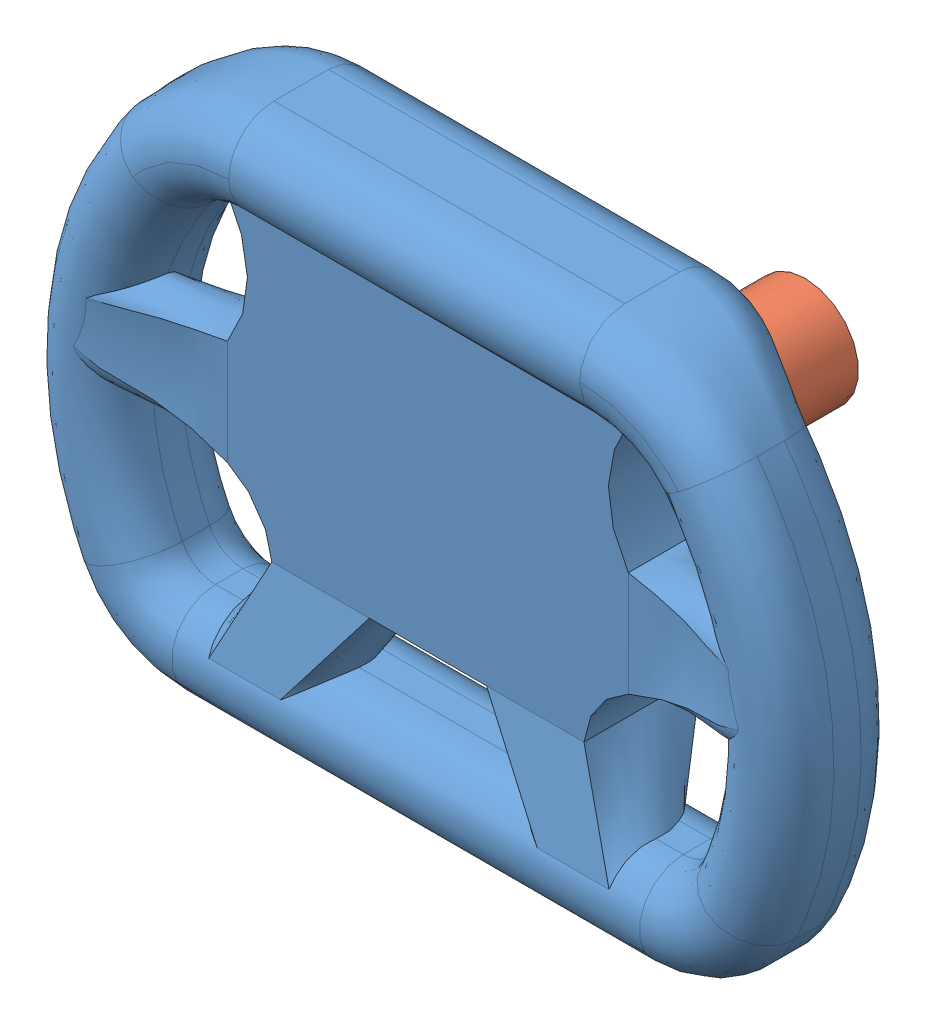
SolidWorks assembly Steering Wheel.SLDASM, configuration Default (file format 5000). Lengths in mm.
Overall size (250.72 174.65 131.11).
2 component instances, 2 part files, 3 mates.
Components (placement in the parent):
- Steering Wheel Mold - CF-1: Steering Wheel Mold - CF.SLDPRT [Default] at origin size (250.72 174.65 64.37)
- Steering Wheel Connector-1: Steering Wheel Connector.SLDPRT [Default] at (0 0 -55.0672) x (1 0 0) z (0 1 0) size (63.5 66.75 63.5)
Mates (geometry in assembly coordinates):
- Concentric18: concentric anti-aligned: circle of Steering Wheel Mold - CF-1; circle of Steering Wheel Connector-1
- Coincident70: coincident aligned: plane of Steering Wheel Connector-1; plane of assembly through (0 0 0) normal (1 0 0)
- Coincident71: coincident anti-aligned: plane of Steering Wheel Mold - CF-1 through (16.0923 18.9061 -45.974) normal (0 0 -1); plane of Steering Wheel Connector-1 through (0 -63.3339 -45.974) normal (0 0 1)
